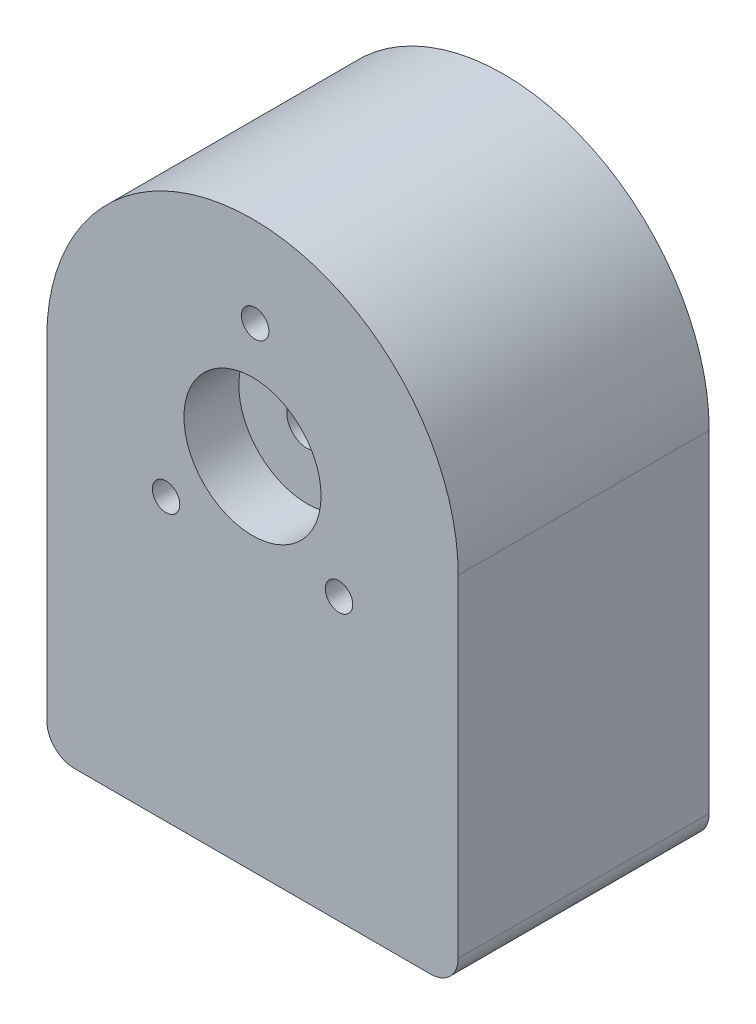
from build123d import *

# Parameters (mm, degrees)
BOSS_EXTRUDE1_DEPTH = 18.3
SKETCH2_R           = 5
CUT_EXTRUDE1_DEPTH  = 4
SKETCH3_R           = 1.5
CUT_EXTRUDE2_DEPTH  = 9
SKETCH5_R           = 1
CUT_EXTRUDE6_DEPTH  = 8.7
FILLET2_R           = 2


with BuildPart() as part:
    # Sketch1 → Boss-Extrude1 (new body)
    with BuildSketch(Plane.XY):
        with BuildLine():
            Line((-26.470588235, 11.552941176), (-26.470588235, -14.647058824))
            Line((-26.470588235, -14.647058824), (3.529411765, -14.647058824))
            Line((3.529411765, -14.647058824), (3.529411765, 11.552941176))
            ThreePointArc((3.529411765, 11.552941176), (-11.470588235, 26.552941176), (-26.470588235, 11.552941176))
        make_face()
    extrude(amount=BOSS_EXTRUDE1_DEPTH)

    # Sketch2 → Cut-Extrude1 (cut)
    with BuildSketch(Plane.XY.offset(18.3)):
        with Locations((-11.470588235, 11.552941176)):
            Circle(SKETCH2_R)
    extrude(amount=-CUT_EXTRUDE1_DEPTH, mode=Mode.SUBTRACT)

    # Sketch3 → Cut-Extrude2 (cut)
    with BuildSketch(Plane.XY.offset(14.3)):
        with Locations((-11.470588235, 11.552941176)):
            Circle(SKETCH3_R)
    extrude(amount=-CUT_EXTRUDE2_DEPTH, mode=Mode.SUBTRACT)

    # Sketch5 → Cut-Extrude6 (cut)
    with BuildSketch(Plane.XY.offset(18.3)):
        with Locations((-11.278885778, 20.052941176)):
            Circle(SKETCH5_R)
        with Locations((-5.165035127, 5.852941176)):
            Circle(SKETCH5_R)
        with Locations((-17.776141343, 5.852941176)):
            Circle(SKETCH5_R)
    extrude(amount=-CUT_EXTRUDE6_DEPTH, mode=Mode.SUBTRACT)

    # Fillet2
    fillet2_edges = [part.edges().sort_by_distance(p)[0] for p in [
        (3.529411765, -14.647058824, 9.15),
        (-26.470588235, -14.647058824, 9.15),
    ]]
    fillet(fillet2_edges, radius=FILLET2_R)


solid = part.part
